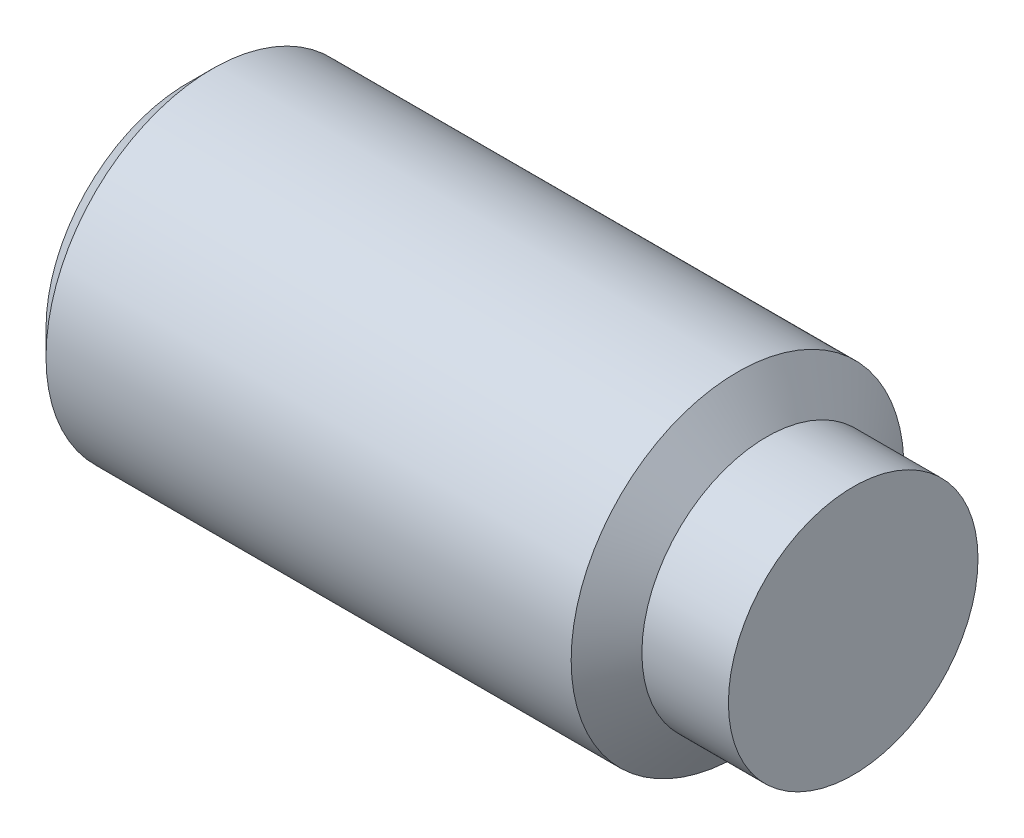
ISO-10303-21;
HEADER;
FILE_DESCRIPTION(('STEP AP214'),'2;1');
FILE_NAME('part.step','',(''),(''),'','','');
FILE_SCHEMA(('AUTOMOTIVE_DESIGN { 1 0 10303 214 1 1 1 1 }'));
ENDSEC;
DATA;
#1=APPLICATION_CONTEXT('core data for automotive mechanical design processes');
#2=APPLICATION_PROTOCOL_DEFINITION('international standard','automotive_design',2000,#1);
#3=PRODUCT_CONTEXT('',#1,'mechanical');
#4=PRODUCT('Part','Part','',(#3));
#5=PRODUCT_RELATED_PRODUCT_CATEGORY('part','',(#4));
#6=PRODUCT_DEFINITION_FORMATION('','',#4);
#7=PRODUCT_DEFINITION_CONTEXT('part definition',#1,'design');
#8=PRODUCT_DEFINITION('design','',#6,#7);
#9=PRODUCT_DEFINITION_SHAPE('','',#8);
#10=(LENGTH_UNIT() NAMED_UNIT(*) SI_UNIT(.MILLI.,.METRE.));
#11=(NAMED_UNIT(*) PLANE_ANGLE_UNIT() SI_UNIT($,.RADIAN.));
#12=(NAMED_UNIT(*) SI_UNIT($,.STERADIAN.) SOLID_ANGLE_UNIT());
#13=UNCERTAINTY_MEASURE_WITH_UNIT(LENGTH_MEASURE(1.E-05),#10,'distance_accuracy_value','');
#14=(GEOMETRIC_REPRESENTATION_CONTEXT(3) GLOBAL_UNCERTAINTY_ASSIGNED_CONTEXT((#13)) GLOBAL_UNIT_ASSIGNED_CONTEXT((#10,
#11,#12)) REPRESENTATION_CONTEXT('',''));
#15=CARTESIAN_POINT('',(0.,0.,0.));
#16=DIRECTION('',(0.,0.,1.));
#17=DIRECTION('',(1.,0.,0.));
#18=AXIS2_PLACEMENT_3D('',#15,#16,#17);
#19=CARTESIAN_POINT('',(0.,0.,0.));
#20=DIRECTION('',(-1.,0.,0.));
#21=DIRECTION('',(0.,0.,1.));
#22=AXIS2_PLACEMENT_3D('',#19,#20,#21);
#23=PLANE('',#22);
#24=CARTESIAN_POINT('',(0.,0.,0.));
#25=DIRECTION('',(-1.,0.,0.));
#26=DIRECTION('',(0.,0.,1.));
#27=AXIS2_PLACEMENT_3D('',#24,#25,#26);
#28=CIRCLE('',#27,10.81024);
#29=CARTESIAN_POINT('',(0.,0.,10.81024));
#30=VERTEX_POINT('',#29);
#31=EDGE_CURVE('E11',#30,#30,#28,.T.);
#32=ORIENTED_EDGE('',*,*,#31,.T.);
#33=EDGE_LOOP('',(#32));
#34=FACE_BOUND('',#33,.T.);
#35=DIRECTION('',(0.,0.,-1.));
#36=VECTOR('',#35,1.);
#37=CARTESIAN_POINT('',(0.,7.1374,4.12077981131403));
#38=LINE('',#37,#36);
#39=CARTESIAN_POINT('',(0.,7.1374,4.12077981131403));
#40=VERTEX_POINT('',#39);
#41=CARTESIAN_POINT('',(0.,7.1374,-4.12077981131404));
#42=VERTEX_POINT('',#41);
#43=EDGE_CURVE('E131',#40,#42,#38,.T.);
#44=ORIENTED_EDGE('',*,*,#43,.F.);
#45=DIRECTION('',(0.,-0.866025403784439,0.5));
#46=VECTOR('',#45,1.);
#47=CARTESIAN_POINT('',(0.,7.1374,4.12077981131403));
#48=LINE('',#47,#46);
#49=CARTESIAN_POINT('',(0.,0.,8.24155962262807));
#50=VERTEX_POINT('',#49);
#51=EDGE_CURVE('E53',#40,#50,#48,.T.);
#52=ORIENTED_EDGE('',*,*,#51,.T.);
#53=DIRECTION('',(0.,0.866025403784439,0.5));
#54=VECTOR('',#53,1.);
#55=CARTESIAN_POINT('',(0.,-7.13739999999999,4.12077981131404));
#56=LINE('',#55,#54);
#57=CARTESIAN_POINT('',(0.,-7.13739999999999,4.12077981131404));
#58=VERTEX_POINT('',#57);
#59=EDGE_CURVE('E122',#58,#50,#56,.T.);
#60=ORIENTED_EDGE('',*,*,#59,.F.);
#61=DIRECTION('',(0.,0.,-1.));
#62=VECTOR('',#61,1.);
#63=CARTESIAN_POINT('',(0.,-7.13739999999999,4.12077981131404));
#64=LINE('',#63,#62);
#65=CARTESIAN_POINT('',(0.,-7.13739999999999,-4.12077981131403));
#66=VERTEX_POINT('',#65);
#67=EDGE_CURVE('E125',#58,#66,#64,.T.);
#68=ORIENTED_EDGE('',*,*,#67,.T.);
#69=DIRECTION('',(0.,0.866025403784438,-0.500000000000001));
#70=VECTOR('',#69,1.);
#71=CARTESIAN_POINT('',(0.,-7.13739999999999,-4.12077981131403));
#72=LINE('',#71,#70);
#73=CARTESIAN_POINT('',(0.,0.,-8.24155962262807));
#74=VERTEX_POINT('',#73);
#75=EDGE_CURVE('E128',#66,#74,#72,.T.);
#76=ORIENTED_EDGE('',*,*,#75,.T.);
#77=DIRECTION('',(0.,-0.866025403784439,-0.5));
#78=VECTOR('',#77,1.);
#79=CARTESIAN_POINT('',(0.,7.1374,-4.12077981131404));
#80=LINE('',#79,#78);
#81=EDGE_CURVE('E111',#42,#74,#80,.T.);
#82=ORIENTED_EDGE('',*,*,#81,.F.);
#83=EDGE_LOOP('',(#44,#52,#60,#68,#76,#82));
#84=FACE_BOUND('',#83,.T.);
#85=ADVANCED_FACE('F39',(#34,#84),#23,.T.);
#86=CARTESIAN_POINT('',(0.,0.,0.));
#87=DIRECTION('',(1.,0.,0.));
#88=DIRECTION('',(0.,0.,-1.));
#89=AXIS2_PLACEMENT_3D('',#86,#87,#88);
#90=CONICAL_SURFACE('',#89,10.81024,0.785398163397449);
#91=CARTESIAN_POINT('',(1.88976,0.,0.));
#92=DIRECTION('',(-1.,0.,0.));
#93=DIRECTION('',(0.,0.,1.));
#94=AXIS2_PLACEMENT_3D('',#91,#92,#93);
#95=CIRCLE('',#94,12.7);
#96=CARTESIAN_POINT('',(1.88976,0.,12.7));
#97=VERTEX_POINT('',#96);
#98=EDGE_CURVE('E46',#97,#97,#95,.T.);
#99=ORIENTED_EDGE('',*,*,#98,.T.);
#100=EDGE_LOOP('',(#99));
#101=FACE_BOUND('',#100,.T.);
#102=ORIENTED_EDGE('',*,*,#31,.F.);
#103=EDGE_LOOP('',(#102));
#104=FACE_BOUND('',#103,.T.);
#105=ADVANCED_FACE('F151',(#101,#104),#90,.T.);
#106=CARTESIAN_POINT('',(-12.7,0.,0.));
#107=DIRECTION('',(-1.,0.,0.));
#108=DIRECTION('',(0.,0.,1.));
#109=AXIS2_PLACEMENT_3D('',#106,#107,#108);
#110=CYLINDRICAL_SURFACE('',#109,12.7);
#111=CARTESIAN_POINT('',(41.9728410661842,0.,0.));
#112=DIRECTION('',(-1.,0.,0.));
#113=DIRECTION('',(0.,0.,1.));
#114=AXIS2_PLACEMENT_3D('',#111,#112,#113);
#115=CIRCLE('',#114,12.7);
#116=CARTESIAN_POINT('',(41.9728410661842,0.,12.7));
#117=VERTEX_POINT('',#116);
#118=EDGE_CURVE('E146',#117,#117,#115,.T.);
#119=ORIENTED_EDGE('',*,*,#118,.T.);
#120=EDGE_LOOP('',(#119));
#121=FACE_BOUND('',#120,.T.);
#122=ORIENTED_EDGE('',*,*,#98,.F.);
#123=EDGE_LOOP('',(#122));
#124=FACE_BOUND('',#123,.T.);
#125=ADVANCED_FACE('F154',(#121,#124),#110,.T.);
#126=CARTESIAN_POINT('',(41.9728410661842,0.,0.));
#127=DIRECTION('',(-1.,0.,0.));
#128=DIRECTION('',(0.,0.,1.));
#129=AXIS2_PLACEMENT_3D('',#126,#127,#128);
#130=CONICAL_SURFACE('',#129,12.7,0.959931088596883);
#131=CARTESIAN_POINT('',(44.196,0.,0.));
#132=DIRECTION('',(-1.,0.,0.));
#133=DIRECTION('',(0.,0.,1.));
#134=AXIS2_PLACEMENT_3D('',#131,#132,#133);
#135=CIRCLE('',#134,9.525);
#136=CARTESIAN_POINT('',(44.196,0.,9.525));
#137=VERTEX_POINT('',#136);
#138=EDGE_CURVE('E143',#137,#137,#135,.T.);
#139=ORIENTED_EDGE('',*,*,#138,.T.);
#140=EDGE_LOOP('',(#139));
#141=FACE_BOUND('',#140,.T.);
#142=ORIENTED_EDGE('',*,*,#118,.F.);
#143=EDGE_LOOP('',(#142));
#144=FACE_BOUND('',#143,.T.);
#145=ADVANCED_FACE('F156',(#141,#144),#130,.T.);
#146=CARTESIAN_POINT('',(-12.7,0.,0.));
#147=DIRECTION('',(-1.,0.,0.));
#148=DIRECTION('',(0.,0.,1.));
#149=AXIS2_PLACEMENT_3D('',#146,#147,#148);
#150=CYLINDRICAL_SURFACE('',#149,9.525);
#151=CARTESIAN_POINT('',(50.8,0.,0.));
#152=DIRECTION('',(-1.,0.,0.));
#153=DIRECTION('',(0.,0.,1.));
#154=AXIS2_PLACEMENT_3D('',#151,#152,#153);
#155=CIRCLE('',#154,9.525);
#156=CARTESIAN_POINT('',(50.8,0.,9.525));
#157=VERTEX_POINT('',#156);
#158=EDGE_CURVE('E140',#157,#157,#155,.T.);
#159=ORIENTED_EDGE('',*,*,#158,.T.);
#160=EDGE_LOOP('',(#159));
#161=FACE_BOUND('',#160,.T.);
#162=ORIENTED_EDGE('',*,*,#138,.F.);
#163=EDGE_LOOP('',(#162));
#164=FACE_BOUND('',#163,.T.);
#165=ADVANCED_FACE('F163',(#161,#164),#150,.T.);
#166=CARTESIAN_POINT('',(50.8,9.525,0.));
#167=DIRECTION('',(1.,0.,0.));
#168=DIRECTION('',(0.,0.,-1.));
#169=AXIS2_PLACEMENT_3D('',#166,#167,#168);
#170=PLANE('',#169);
#171=ORIENTED_EDGE('',*,*,#158,.F.);
#172=EDGE_LOOP('',(#171));
#173=FACE_BOUND('',#172,.T.);
#174=ADVANCED_FACE('F199',(#173),#170,.T.);
#175=CARTESIAN_POINT('',(14.2748,7.1374,4.12077981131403));
#176=DIRECTION('',(0.,-0.5,-0.866025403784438));
#177=DIRECTION('',(0.,0.866025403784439,-0.5));
#178=AXIS2_PLACEMENT_3D('',#175,#176,#177);
#179=PLANE('',#178);
#180=ORIENTED_EDGE('',*,*,#51,.F.);
#181=DIRECTION('',(-1.,0.,0.));
#182=VECTOR('',#181,1.);
#183=CARTESIAN_POINT('',(14.2748,7.1374,4.12077981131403));
#184=LINE('',#183,#182);
#185=CARTESIAN_POINT('',(14.2748,7.1374,4.12077981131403));
#186=VERTEX_POINT('',#185);
#187=EDGE_CURVE('E58',#186,#40,#184,.T.);
#188=ORIENTED_EDGE('',*,*,#187,.F.);
#189=DIRECTION('',(0.,-0.866025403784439,0.5));
#190=VECTOR('',#189,1.);
#191=CARTESIAN_POINT('',(14.2748,7.1374,4.12077981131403));
#192=LINE('',#191,#190);
#193=CARTESIAN_POINT('',(14.2748,0.,8.24155962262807));
#194=VERTEX_POINT('',#193);
#195=EDGE_CURVE('E85',#186,#194,#192,.T.);
#196=ORIENTED_EDGE('',*,*,#195,.T.);
#197=DIRECTION('',(-1.,0.,0.));
#198=VECTOR('',#197,1.);
#199=CARTESIAN_POINT('',(14.2748,0.,8.24155962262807));
#200=LINE('',#199,#198);
#201=EDGE_CURVE('E138',#194,#50,#200,.T.);
#202=ORIENTED_EDGE('',*,*,#201,.T.);
#203=EDGE_LOOP('',(#180,#188,#196,#202));
#204=FACE_BOUND('',#203,.T.);
#205=ADVANCED_FACE('F196',(#204),#179,.T.);
#206=CARTESIAN_POINT('',(14.2748,-7.13739999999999,4.12077981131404));
#207=DIRECTION('',(0.,-0.5,0.866025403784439));
#208=DIRECTION('',(0.,-0.866025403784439,-0.5));
#209=AXIS2_PLACEMENT_3D('',#206,#207,#208);
#210=PLANE('',#209);
#211=ORIENTED_EDGE('',*,*,#59,.T.);
#212=ORIENTED_EDGE('',*,*,#201,.F.);
#213=DIRECTION('',(0.,0.866025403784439,0.5));
#214=VECTOR('',#213,1.);
#215=CARTESIAN_POINT('',(14.2748,-7.13739999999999,4.12077981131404));
#216=LINE('',#215,#214);
#217=CARTESIAN_POINT('',(14.2748,-7.13739999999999,4.12077981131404));
#218=VERTEX_POINT('',#217);
#219=EDGE_CURVE('E284',#218,#194,#216,.T.);
#220=ORIENTED_EDGE('',*,*,#219,.F.);
#221=DIRECTION('',(-1.,0.,0.));
#222=VECTOR('',#221,1.);
#223=CARTESIAN_POINT('',(14.2748,-7.13739999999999,4.12077981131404));
#224=LINE('',#223,#222);
#225=EDGE_CURVE('E136',#218,#58,#224,.T.);
#226=ORIENTED_EDGE('',*,*,#225,.T.);
#227=EDGE_LOOP('',(#211,#212,#220,#226));
#228=FACE_BOUND('',#227,.T.);
#229=ADVANCED_FACE('F192',(#228),#210,.F.);
#230=CARTESIAN_POINT('',(14.2748,-7.13739999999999,4.12077981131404));
#231=DIRECTION('',(0.,1.,0.));
#232=DIRECTION('',(0.,0.,1.));
#233=AXIS2_PLACEMENT_3D('',#230,#231,#232);
#234=PLANE('',#233);
#235=ORIENTED_EDGE('',*,*,#67,.F.);
#236=ORIENTED_EDGE('',*,*,#225,.F.);
#237=DIRECTION('',(0.,0.,-1.));
#238=VECTOR('',#237,1.);
#239=CARTESIAN_POINT('',(14.2748,-7.13739999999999,4.12077981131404));
#240=LINE('',#239,#238);
#241=CARTESIAN_POINT('',(14.2748,-7.13739999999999,-4.12077981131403));
#242=VERTEX_POINT('',#241);
#243=EDGE_CURVE('E106',#218,#242,#240,.T.);
#244=ORIENTED_EDGE('',*,*,#243,.T.);
#245=DIRECTION('',(-1.,0.,0.));
#246=VECTOR('',#245,1.);
#247=CARTESIAN_POINT('',(14.2748,-7.13739999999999,-4.12077981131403));
#248=LINE('',#247,#246);
#249=EDGE_CURVE('E101',#242,#66,#248,.T.);
#250=ORIENTED_EDGE('',*,*,#249,.T.);
#251=EDGE_LOOP('',(#235,#236,#244,#250));
#252=FACE_BOUND('',#251,.T.);
#253=ADVANCED_FACE('F189',(#252),#234,.T.);
#254=CARTESIAN_POINT('',(14.2748,-7.13739999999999,-4.12077981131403));
#255=DIRECTION('',(0.,0.500000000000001,0.866025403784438));
#256=DIRECTION('',(0.,-0.866025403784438,0.500000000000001));
#257=AXIS2_PLACEMENT_3D('',#254,#255,#256);
#258=PLANE('',#257);
#259=ORIENTED_EDGE('',*,*,#75,.F.);
#260=ORIENTED_EDGE('',*,*,#249,.F.);
#261=DIRECTION('',(0.,0.866025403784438,-0.500000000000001));
#262=VECTOR('',#261,1.);
#263=CARTESIAN_POINT('',(14.2748,-7.13739999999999,-4.12077981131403));
#264=LINE('',#263,#262);
#265=CARTESIAN_POINT('',(14.2748,0.,-8.24155962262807));
#266=VERTEX_POINT('',#265);
#267=EDGE_CURVE('E96',#242,#266,#264,.T.);
#268=ORIENTED_EDGE('',*,*,#267,.T.);
#269=DIRECTION('',(-1.,0.,0.));
#270=VECTOR('',#269,1.);
#271=CARTESIAN_POINT('',(14.2748,0.,-8.24155962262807));
#272=LINE('',#271,#270);
#273=EDGE_CURVE('E100',#266,#74,#272,.T.);
#274=ORIENTED_EDGE('',*,*,#273,.T.);
#275=EDGE_LOOP('',(#259,#260,#268,#274));
#276=FACE_BOUND('',#275,.T.);
#277=ADVANCED_FACE('F99',(#276),#258,.T.);
#278=CARTESIAN_POINT('',(14.2748,7.1374,-4.12077981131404));
#279=DIRECTION('',(0.,0.5,-0.866025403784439));
#280=DIRECTION('',(0.,0.866025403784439,0.5));
#281=AXIS2_PLACEMENT_3D('',#278,#279,#280);
#282=PLANE('',#281);
#283=ORIENTED_EDGE('',*,*,#81,.T.);
#284=ORIENTED_EDGE('',*,*,#273,.F.);
#285=DIRECTION('',(0.,-0.866025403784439,-0.5));
#286=VECTOR('',#285,1.);
#287=CARTESIAN_POINT('',(14.2748,7.1374,-4.12077981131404));
#288=LINE('',#287,#286);
#289=CARTESIAN_POINT('',(14.2748,7.1374,-4.12077981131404));
#290=VERTEX_POINT('',#289);
#291=EDGE_CURVE('E105',#290,#266,#288,.T.);
#292=ORIENTED_EDGE('',*,*,#291,.F.);
#293=DIRECTION('',(-1.,0.,0.));
#294=VECTOR('',#293,1.);
#295=CARTESIAN_POINT('',(14.2748,7.1374,-4.12077981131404));
#296=LINE('',#295,#294);
#297=EDGE_CURVE('E81',#290,#42,#296,.T.);
#298=ORIENTED_EDGE('',*,*,#297,.T.);
#299=EDGE_LOOP('',(#283,#284,#292,#298));
#300=FACE_BOUND('',#299,.T.);
#301=ADVANCED_FACE('F108',(#300),#282,.F.);
#302=CARTESIAN_POINT('',(14.2748,7.1374,4.12077981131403));
#303=DIRECTION('',(0.,1.,0.));
#304=DIRECTION('',(0.,0.,1.));
#305=AXIS2_PLACEMENT_3D('',#302,#303,#304);
#306=PLANE('',#305);
#307=ORIENTED_EDGE('',*,*,#43,.T.);
#308=ORIENTED_EDGE('',*,*,#297,.F.);
#309=DIRECTION('',(0.,0.,-1.));
#310=VECTOR('',#309,1.);
#311=CARTESIAN_POINT('',(14.2748,7.1374,4.12077981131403));
#312=LINE('',#311,#310);
#313=EDGE_CURVE('E116',#186,#290,#312,.T.);
#314=ORIENTED_EDGE('',*,*,#313,.F.);
#315=ORIENTED_EDGE('',*,*,#187,.T.);
#316=EDGE_LOOP('',(#307,#308,#314,#315));
#317=FACE_BOUND('',#316,.T.);
#318=ADVANCED_FACE('F177',(#317),#306,.F.);
#319=CARTESIAN_POINT('',(14.2748,14.2748,0.));
#320=DIRECTION('',(1.,0.,0.));
#321=DIRECTION('',(0.,0.,-1.));
#322=AXIS2_PLACEMENT_3D('',#319,#320,#321);
#323=PLANE('',#322);
#324=ORIENTED_EDGE('',*,*,#195,.F.);
#325=ORIENTED_EDGE('',*,*,#313,.T.);
#326=ORIENTED_EDGE('',*,*,#291,.T.);
#327=ORIENTED_EDGE('',*,*,#267,.F.);
#328=ORIENTED_EDGE('',*,*,#243,.F.);
#329=ORIENTED_EDGE('',*,*,#219,.T.);
#330=EDGE_LOOP('',(#324,#325,#326,#327,#328,#329));
#331=FACE_BOUND('',#330,.T.);
#332=ADVANCED_FACE('F114',(#331),#323,.F.);
#333=CLOSED_SHELL('',(#85,#105,#125,#145,#165,#174,#205,#229,#253,#277,#301,#318,#332));
#334=MANIFOLD_SOLID_BREP('B2',#333);
#335=ADVANCED_BREP_SHAPE_REPRESENTATION('',(#18,#334),#14);
#336=SHAPE_DEFINITION_REPRESENTATION(#9,#335);
ENDSEC;
END-ISO-10303-21;
